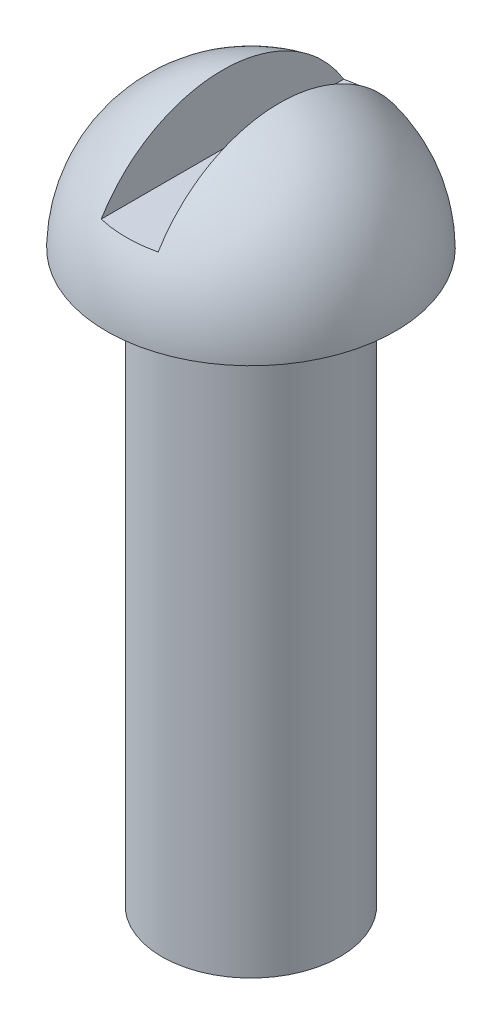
from build123d import *

# Parameters (mm, degrees)
CUT_EXTRUDE1_DEPTH      = 22.588774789
CUT_EXTRUDE1_DEPTH_BACK = 22.588774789


with BuildPart() as part:
    # Sketch1 → Base-Revolve (revolve)
    with BuildSketch(Plane.XY):
        with BuildLine():
            Line((5.1562, 0), (3.175, 0))
            Line((3.175, 0), (3.175, -20.32))
            Line((3.175, -20.32), (0, -20.32))
            Line((0, -20.32), (0, 5.08))
            ThreePointArc((0, 5.08), (3.619143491, 3.596659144), (5.1562, 0))
        make_face()
    revolve(axis=Axis((0, 10.110523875, 0), (0, -1, 0)))

    # Sketch2 → Cut-Extrude1 (cut, two sides: drawn at the far end of the back side and taken through both)
    with BuildSketch(Plane.XY.offset(-CUT_EXTRUDE1_DEPTH_BACK)):
        with BuildLine():
            Line((-1.016, 4.978921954), (-1.016, 2.54))
            Line((-1.016, 2.54), (1.016, 2.54))
            Line((1.016, 2.54), (1.016, 4.978921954))
            ThreePointArc((1.016, 4.978921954), (0, 5.08), (-1.016, 4.978921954))
        make_face()
    extrude(amount=CUT_EXTRUDE1_DEPTH + CUT_EXTRUDE1_DEPTH_BACK, mode=Mode.SUBTRACT)


solid = part.part
